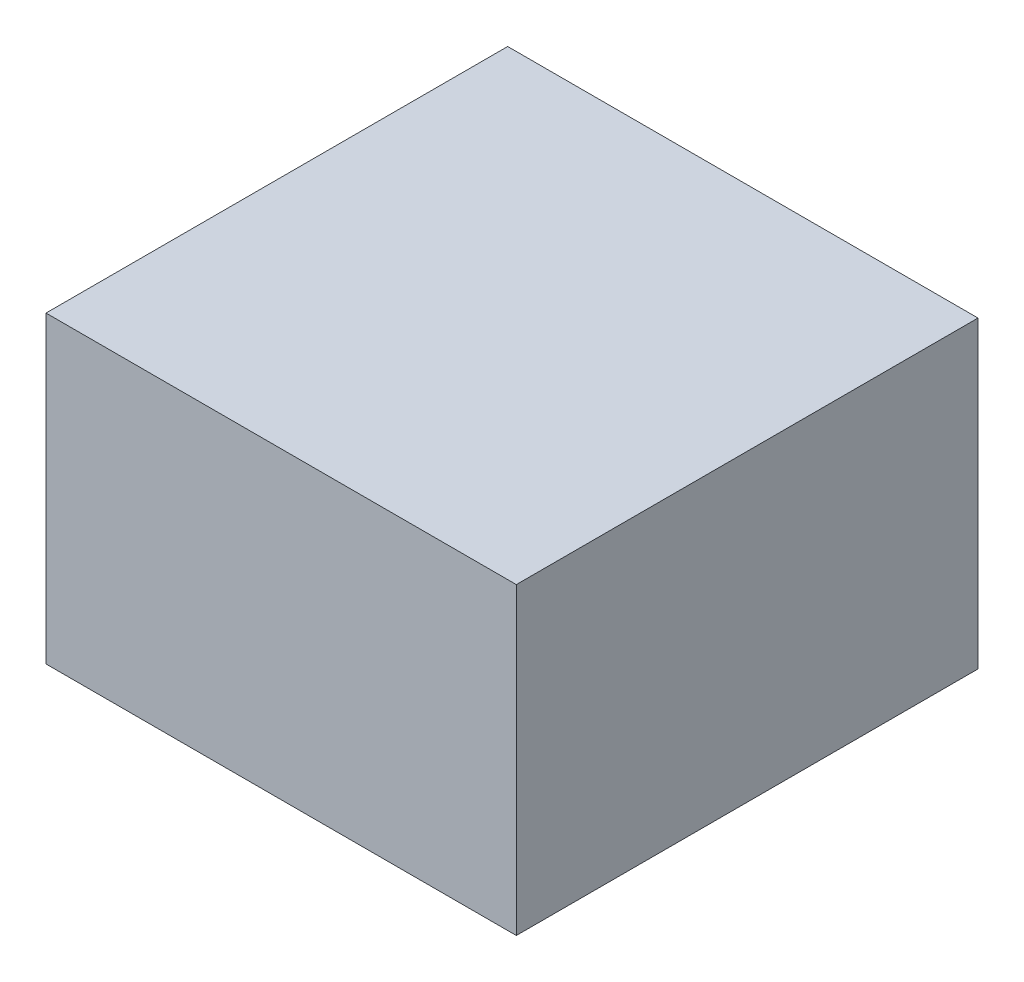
ISO-10303-21;
HEADER;
FILE_DESCRIPTION(('STEP AP214'),'2;1');
FILE_NAME('part.step','',(''),(''),'','','');
FILE_SCHEMA(('AUTOMOTIVE_DESIGN { 1 0 10303 214 1 1 1 1 }'));
ENDSEC;
DATA;
#1=APPLICATION_CONTEXT('core data for automotive mechanical design processes');
#2=APPLICATION_PROTOCOL_DEFINITION('international standard','automotive_design',2000,#1);
#3=PRODUCT_CONTEXT('',#1,'mechanical');
#4=PRODUCT('Part','Part','',(#3));
#5=PRODUCT_RELATED_PRODUCT_CATEGORY('part','',(#4));
#6=PRODUCT_DEFINITION_FORMATION('','',#4);
#7=PRODUCT_DEFINITION_CONTEXT('part definition',#1,'design');
#8=PRODUCT_DEFINITION('design','',#6,#7);
#9=PRODUCT_DEFINITION_SHAPE('','',#8);
#10=(LENGTH_UNIT() NAMED_UNIT(*) SI_UNIT(.MILLI.,.METRE.));
#11=(NAMED_UNIT(*) PLANE_ANGLE_UNIT() SI_UNIT($,.RADIAN.));
#12=(NAMED_UNIT(*) SI_UNIT($,.STERADIAN.) SOLID_ANGLE_UNIT());
#13=UNCERTAINTY_MEASURE_WITH_UNIT(LENGTH_MEASURE(1.E-05),#10,'distance_accuracy_value','');
#14=(GEOMETRIC_REPRESENTATION_CONTEXT(3) GLOBAL_UNCERTAINTY_ASSIGNED_CONTEXT((#13)) GLOBAL_UNIT_ASSIGNED_CONTEXT((#10,
#11,#12)) REPRESENTATION_CONTEXT('',''));
#15=CARTESIAN_POINT('',(0.,0.,0.));
#16=DIRECTION('',(0.,0.,1.));
#17=DIRECTION('',(1.,0.,0.));
#18=AXIS2_PLACEMENT_3D('',#15,#16,#17);
#19=CARTESIAN_POINT('',(0.,0.,66.04));
#20=DIRECTION('',(1.,0.,0.));
#21=DIRECTION('',(0.,0.,-1.));
#22=AXIS2_PLACEMENT_3D('',#19,#20,#21);
#23=PLANE('',#22);
#24=DIRECTION('',(0.,-1.,0.));
#25=VECTOR('',#24,1.);
#26=CARTESIAN_POINT('',(0.,0.,0.));
#27=LINE('',#26,#25);
#28=CARTESIAN_POINT('',(0.,43.4727097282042,0.));
#29=VERTEX_POINT('',#28);
#30=CARTESIAN_POINT('',(0.,0.,0.));
#31=VERTEX_POINT('',#30);
#32=EDGE_CURVE('E93',#29,#31,#27,.T.);
#33=ORIENTED_EDGE('',*,*,#32,.T.);
#34=DIRECTION('',(0.,0.,-1.));
#35=VECTOR('',#34,1.);
#36=CARTESIAN_POINT('',(0.,0.,66.04));
#37=LINE('',#36,#35);
#38=CARTESIAN_POINT('',(0.,0.,66.04));
#39=VERTEX_POINT('',#38);
#40=EDGE_CURVE('E11',#39,#31,#37,.T.);
#41=ORIENTED_EDGE('',*,*,#40,.F.);
#42=DIRECTION('',(0.,-1.,0.));
#43=VECTOR('',#42,1.);
#44=CARTESIAN_POINT('',(0.,0.,66.04));
#45=LINE('',#44,#43);
#46=CARTESIAN_POINT('',(0.,43.4727097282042,66.04));
#47=VERTEX_POINT('',#46);
#48=EDGE_CURVE('E81',#47,#39,#45,.T.);
#49=ORIENTED_EDGE('',*,*,#48,.F.);
#50=DIRECTION('',(0.,0.,-1.));
#51=VECTOR('',#50,1.);
#52=CARTESIAN_POINT('',(0.,43.4727097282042,66.04));
#53=LINE('',#52,#51);
#54=EDGE_CURVE('E89',#47,#29,#53,.T.);
#55=ORIENTED_EDGE('',*,*,#54,.T.);
#56=EDGE_LOOP('',(#33,#41,#49,#55));
#57=FACE_BOUND('',#56,.T.);
#58=ADVANCED_FACE('F30',(#57),#23,.F.);
#59=CARTESIAN_POINT('',(0.,0.,66.04));
#60=DIRECTION('',(0.,1.,0.));
#61=DIRECTION('',(0.,0.,1.));
#62=AXIS2_PLACEMENT_3D('',#59,#60,#61);
#63=PLANE('',#62);
#64=DIRECTION('',(1.,0.,0.));
#65=VECTOR('',#64,1.);
#66=CARTESIAN_POINT('',(0.,0.,0.));
#67=LINE('',#66,#65);
#68=CARTESIAN_POINT('',(67.274916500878,0.,0.));
#69=VERTEX_POINT('',#68);
#70=EDGE_CURVE('E85',#31,#69,#67,.T.);
#71=ORIENTED_EDGE('',*,*,#70,.T.);
#72=DIRECTION('',(0.,0.,-1.));
#73=VECTOR('',#72,1.);
#74=CARTESIAN_POINT('',(67.274916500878,0.,66.04));
#75=LINE('',#74,#73);
#76=CARTESIAN_POINT('',(67.274916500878,0.,66.04));
#77=VERTEX_POINT('',#76);
#78=EDGE_CURVE('E38',#77,#69,#75,.T.);
#79=ORIENTED_EDGE('',*,*,#78,.F.);
#80=DIRECTION('',(1.,0.,0.));
#81=VECTOR('',#80,1.);
#82=CARTESIAN_POINT('',(0.,0.,66.04));
#83=LINE('',#82,#81);
#84=EDGE_CURVE('E76',#39,#77,#83,.T.);
#85=ORIENTED_EDGE('',*,*,#84,.F.);
#86=ORIENTED_EDGE('',*,*,#40,.T.);
#87=EDGE_LOOP('',(#71,#79,#85,#86));
#88=FACE_BOUND('',#87,.T.);
#89=ADVANCED_FACE('F84',(#88),#63,.F.);
#90=CARTESIAN_POINT('',(67.274916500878,0.,66.04));
#91=DIRECTION('',(-1.,0.,0.));
#92=DIRECTION('',(0.,0.,1.));
#93=AXIS2_PLACEMENT_3D('',#90,#91,#92);
#94=PLANE('',#93);
#95=DIRECTION('',(0.,1.,0.));
#96=VECTOR('',#95,1.);
#97=CARTESIAN_POINT('',(67.274916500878,0.,0.));
#98=LINE('',#97,#96);
#99=CARTESIAN_POINT('',(67.274916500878,43.4727097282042,0.));
#100=VERTEX_POINT('',#99);
#101=EDGE_CURVE('E63',#69,#100,#98,.T.);
#102=ORIENTED_EDGE('',*,*,#101,.T.);
#103=DIRECTION('',(0.,0.,-1.));
#104=VECTOR('',#103,1.);
#105=CARTESIAN_POINT('',(67.274916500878,43.4727097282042,66.04));
#106=LINE('',#105,#104);
#107=CARTESIAN_POINT('',(67.274916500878,43.4727097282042,66.04));
#108=VERTEX_POINT('',#107);
#109=EDGE_CURVE('E86',#108,#100,#106,.T.);
#110=ORIENTED_EDGE('',*,*,#109,.F.);
#111=DIRECTION('',(0.,1.,0.));
#112=VECTOR('',#111,1.);
#113=CARTESIAN_POINT('',(67.274916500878,0.,66.04));
#114=LINE('',#113,#112);
#115=EDGE_CURVE('E79',#77,#108,#114,.T.);
#116=ORIENTED_EDGE('',*,*,#115,.F.);
#117=ORIENTED_EDGE('',*,*,#78,.T.);
#118=EDGE_LOOP('',(#102,#110,#116,#117));
#119=FACE_BOUND('',#118,.T.);
#120=ADVANCED_FACE('F87',(#119),#94,.F.);
#121=CARTESIAN_POINT('',(0.,43.4727097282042,66.04));
#122=DIRECTION('',(0.,-1.,0.));
#123=DIRECTION('',(0.,0.,-1.));
#124=AXIS2_PLACEMENT_3D('',#121,#122,#123);
#125=PLANE('',#124);
#126=DIRECTION('',(-1.,0.,0.));
#127=VECTOR('',#126,1.);
#128=CARTESIAN_POINT('',(0.,43.4727097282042,0.));
#129=LINE('',#128,#127);
#130=EDGE_CURVE('E69',#100,#29,#129,.T.);
#131=ORIENTED_EDGE('',*,*,#130,.T.);
#132=ORIENTED_EDGE('',*,*,#54,.F.);
#133=DIRECTION('',(-1.,0.,0.));
#134=VECTOR('',#133,1.);
#135=CARTESIAN_POINT('',(0.,43.4727097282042,66.04));
#136=LINE('',#135,#134);
#137=EDGE_CURVE('E46',#108,#47,#136,.T.);
#138=ORIENTED_EDGE('',*,*,#137,.F.);
#139=ORIENTED_EDGE('',*,*,#109,.T.);
#140=EDGE_LOOP('',(#131,#132,#138,#139));
#141=FACE_BOUND('',#140,.T.);
#142=ADVANCED_FACE('F100',(#141),#125,.F.);
#143=CARTESIAN_POINT('',(0.,43.4727097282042,66.04));
#144=DIRECTION('',(0.,0.,-1.));
#145=DIRECTION('',(-1.,0.,0.));
#146=AXIS2_PLACEMENT_3D('',#143,#144,#145);
#147=PLANE('',#146);
#148=ORIENTED_EDGE('',*,*,#48,.T.);
#149=ORIENTED_EDGE('',*,*,#84,.T.);
#150=ORIENTED_EDGE('',*,*,#115,.T.);
#151=ORIENTED_EDGE('',*,*,#137,.T.);
#152=EDGE_LOOP('',(#148,#149,#150,#151));
#153=FACE_BOUND('',#152,.T.);
#154=ADVANCED_FACE('F77',(#153),#147,.F.);
#155=CARTESIAN_POINT('',(0.,43.4727097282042,0.));
#156=DIRECTION('',(0.,0.,-1.));
#157=DIRECTION('',(-1.,0.,0.));
#158=AXIS2_PLACEMENT_3D('',#155,#156,#157);
#159=PLANE('',#158);
#160=ORIENTED_EDGE('',*,*,#32,.F.);
#161=ORIENTED_EDGE('',*,*,#130,.F.);
#162=ORIENTED_EDGE('',*,*,#101,.F.);
#163=ORIENTED_EDGE('',*,*,#70,.F.);
#164=EDGE_LOOP('',(#160,#161,#162,#163));
#165=FACE_BOUND('',#164,.T.);
#166=ADVANCED_FACE('F103',(#165),#159,.T.);
#167=CLOSED_SHELL('',(#58,#89,#120,#142,#154,#166));
#168=MANIFOLD_SOLID_BREP('B2',#167);
#169=ADVANCED_BREP_SHAPE_REPRESENTATION('',(#18,#168),#14);
#170=SHAPE_DEFINITION_REPRESENTATION(#9,#169);
ENDSEC;
END-ISO-10303-21;
